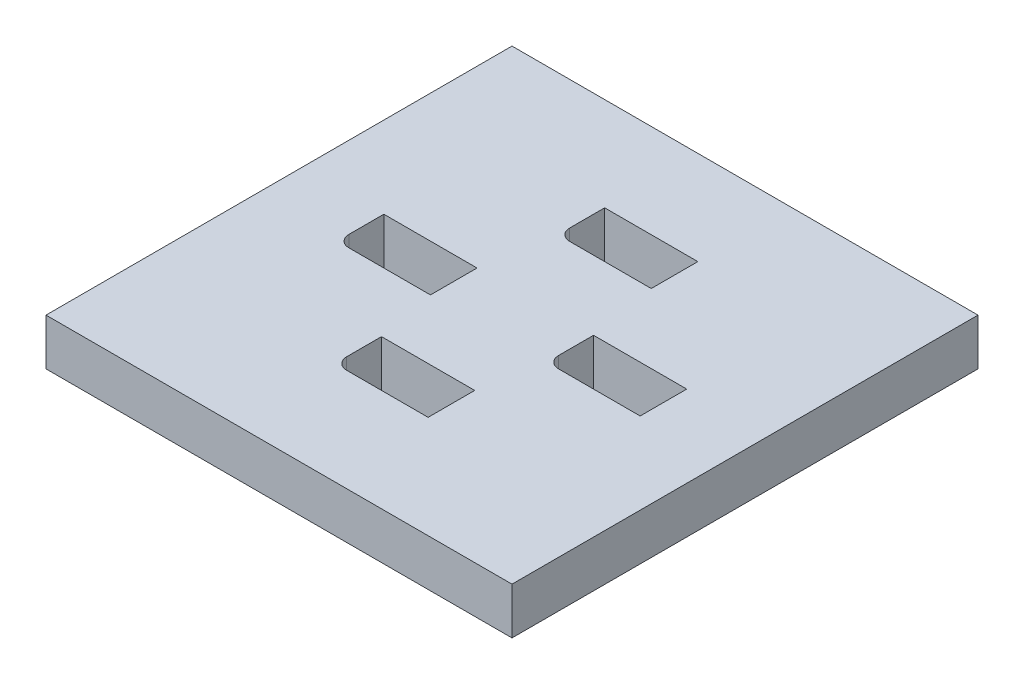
ISO-10303-21;
HEADER;
FILE_DESCRIPTION(('STEP AP214'),'2;1');
FILE_NAME('part.step','',(''),(''),'','','');
FILE_SCHEMA(('AUTOMOTIVE_DESIGN { 1 0 10303 214 1 1 1 1 }'));
ENDSEC;
DATA;
#1=APPLICATION_CONTEXT('core data for automotive mechanical design processes');
#2=APPLICATION_PROTOCOL_DEFINITION('international standard','automotive_design',2000,#1);
#3=PRODUCT_CONTEXT('',#1,'mechanical');
#4=PRODUCT('Part','Part','',(#3));
#5=PRODUCT_RELATED_PRODUCT_CATEGORY('part','',(#4));
#6=PRODUCT_DEFINITION_FORMATION('','',#4);
#7=PRODUCT_DEFINITION_CONTEXT('part definition',#1,'design');
#8=PRODUCT_DEFINITION('design','',#6,#7);
#9=PRODUCT_DEFINITION_SHAPE('','',#8);
#10=(LENGTH_UNIT() NAMED_UNIT(*) SI_UNIT(.MILLI.,.METRE.));
#11=(NAMED_UNIT(*) PLANE_ANGLE_UNIT() SI_UNIT($,.RADIAN.));
#12=(NAMED_UNIT(*) SI_UNIT($,.STERADIAN.) SOLID_ANGLE_UNIT());
#13=UNCERTAINTY_MEASURE_WITH_UNIT(LENGTH_MEASURE(1.E-05),#10,'distance_accuracy_value','');
#14=(GEOMETRIC_REPRESENTATION_CONTEXT(3) GLOBAL_UNCERTAINTY_ASSIGNED_CONTEXT((#13)) GLOBAL_UNIT_ASSIGNED_CONTEXT((#10,
#11,#12)) REPRESENTATION_CONTEXT('',''));
#15=CARTESIAN_POINT('',(0.,0.,0.));
#16=DIRECTION('',(0.,0.,1.));
#17=DIRECTION('',(1.,0.,0.));
#18=AXIS2_PLACEMENT_3D('',#15,#16,#17);
#19=CARTESIAN_POINT('',(63.5,12.7,63.5));
#20=DIRECTION('',(-1.,0.,0.));
#21=DIRECTION('',(0.,0.,1.));
#22=AXIS2_PLACEMENT_3D('',#19,#20,#21);
#23=PLANE('',#22);
#24=DIRECTION('',(0.,0.,-1.));
#25=VECTOR('',#24,1.);
#26=CARTESIAN_POINT('',(63.5,0.,63.5));
#27=LINE('',#26,#25);
#28=CARTESIAN_POINT('',(63.5,0.,63.5));
#29=VERTEX_POINT('',#28);
#30=CARTESIAN_POINT('',(63.5,0.,-63.5));
#31=VERTEX_POINT('',#30);
#32=EDGE_CURVE('E242',#29,#31,#27,.T.);
#33=ORIENTED_EDGE('',*,*,#32,.T.);
#34=DIRECTION('',(0.,-1.,0.));
#35=VECTOR('',#34,1.);
#36=CARTESIAN_POINT('',(63.5,12.7,-63.5));
#37=LINE('',#36,#35);
#38=CARTESIAN_POINT('',(63.5,12.7,-63.5));
#39=VERTEX_POINT('',#38);
#40=EDGE_CURVE('E12',#39,#31,#37,.T.);
#41=ORIENTED_EDGE('',*,*,#40,.F.);
#42=DIRECTION('',(0.,0.,-1.));
#43=VECTOR('',#42,1.);
#44=CARTESIAN_POINT('',(63.5,12.7,63.5));
#45=LINE('',#44,#43);
#46=CARTESIAN_POINT('',(63.5,12.7,63.5));
#47=VERTEX_POINT('',#46);
#48=EDGE_CURVE('E366',#47,#39,#45,.T.);
#49=ORIENTED_EDGE('',*,*,#48,.F.);
#50=DIRECTION('',(0.,-1.,0.));
#51=VECTOR('',#50,1.);
#52=CARTESIAN_POINT('',(63.5,12.7,63.5));
#53=LINE('',#52,#51);
#54=EDGE_CURVE('E376',#47,#29,#53,.T.);
#55=ORIENTED_EDGE('',*,*,#54,.T.);
#56=EDGE_LOOP('',(#33,#41,#49,#55));
#57=FACE_BOUND('',#56,.T.);
#58=ADVANCED_FACE('F39',(#57),#23,.F.);
#59=CARTESIAN_POINT('',(-63.5,12.7,-63.5));
#60=DIRECTION('',(0.,0.,1.));
#61=DIRECTION('',(1.,0.,0.));
#62=AXIS2_PLACEMENT_3D('',#59,#60,#61);
#63=PLANE('',#62);
#64=DIRECTION('',(-1.,0.,0.));
#65=VECTOR('',#64,1.);
#66=CARTESIAN_POINT('',(-63.5,0.,-63.5));
#67=LINE('',#66,#65);
#68=CARTESIAN_POINT('',(-63.5,0.,-63.5));
#69=VERTEX_POINT('',#68);
#70=EDGE_CURVE('E379',#31,#69,#67,.T.);
#71=ORIENTED_EDGE('',*,*,#70,.T.);
#72=DIRECTION('',(0.,-1.,0.));
#73=VECTOR('',#72,1.);
#74=CARTESIAN_POINT('',(-63.5,12.7,-63.5));
#75=LINE('',#74,#73);
#76=CARTESIAN_POINT('',(-63.5,12.7,-63.5));
#77=VERTEX_POINT('',#76);
#78=EDGE_CURVE('E46',#77,#69,#75,.T.);
#79=ORIENTED_EDGE('',*,*,#78,.F.);
#80=DIRECTION('',(-1.,0.,0.));
#81=VECTOR('',#80,1.);
#82=CARTESIAN_POINT('',(-63.5,12.7,-63.5));
#83=LINE('',#82,#81);
#84=EDGE_CURVE('E369',#39,#77,#83,.T.);
#85=ORIENTED_EDGE('',*,*,#84,.F.);
#86=ORIENTED_EDGE('',*,*,#40,.T.);
#87=EDGE_LOOP('',(#71,#79,#85,#86));
#88=FACE_BOUND('',#87,.T.);
#89=ADVANCED_FACE('F410',(#88),#63,.F.);
#90=CARTESIAN_POINT('',(-63.5,12.7,63.5));
#91=DIRECTION('',(1.,0.,0.));
#92=DIRECTION('',(0.,0.,-1.));
#93=AXIS2_PLACEMENT_3D('',#90,#91,#92);
#94=PLANE('',#93);
#95=DIRECTION('',(0.,0.,1.));
#96=VECTOR('',#95,1.);
#97=CARTESIAN_POINT('',(-63.5,0.,63.5));
#98=LINE('',#97,#96);
#99=CARTESIAN_POINT('',(-63.5,0.,63.5));
#100=VERTEX_POINT('',#99);
#101=EDGE_CURVE('E381',#69,#100,#98,.T.);
#102=ORIENTED_EDGE('',*,*,#101,.T.);
#103=DIRECTION('',(0.,-1.,0.));
#104=VECTOR('',#103,1.);
#105=CARTESIAN_POINT('',(-63.5,12.7,63.5));
#106=LINE('',#105,#104);
#107=CARTESIAN_POINT('',(-63.5,12.7,63.5));
#108=VERTEX_POINT('',#107);
#109=EDGE_CURVE('E386',#108,#100,#106,.T.);
#110=ORIENTED_EDGE('',*,*,#109,.F.);
#111=DIRECTION('',(0.,0.,1.));
#112=VECTOR('',#111,1.);
#113=CARTESIAN_POINT('',(-63.5,12.7,63.5));
#114=LINE('',#113,#112);
#115=EDGE_CURVE('E372',#77,#108,#114,.T.);
#116=ORIENTED_EDGE('',*,*,#115,.F.);
#117=ORIENTED_EDGE('',*,*,#78,.T.);
#118=EDGE_LOOP('',(#102,#110,#116,#117));
#119=FACE_BOUND('',#118,.T.);
#120=ADVANCED_FACE('F395',(#119),#94,.F.);
#121=CARTESIAN_POINT('',(-63.5,12.7,63.5));
#122=DIRECTION('',(0.,0.,-1.));
#123=DIRECTION('',(-1.,0.,0.));
#124=AXIS2_PLACEMENT_3D('',#121,#122,#123);
#125=PLANE('',#124);
#126=DIRECTION('',(1.,0.,0.));
#127=VECTOR('',#126,1.);
#128=CARTESIAN_POINT('',(-63.5,0.,63.5));
#129=LINE('',#128,#127);
#130=EDGE_CURVE('E370',#100,#29,#129,.T.);
#131=ORIENTED_EDGE('',*,*,#130,.T.);
#132=ORIENTED_EDGE('',*,*,#54,.F.);
#133=DIRECTION('',(1.,0.,0.));
#134=VECTOR('',#133,1.);
#135=CARTESIAN_POINT('',(-63.5,12.7,63.5));
#136=LINE('',#135,#134);
#137=EDGE_CURVE('E374',#108,#47,#136,.T.);
#138=ORIENTED_EDGE('',*,*,#137,.F.);
#139=ORIENTED_EDGE('',*,*,#109,.T.);
#140=EDGE_LOOP('',(#131,#132,#138,#139));
#141=FACE_BOUND('',#140,.T.);
#142=ADVANCED_FACE('F403',(#141),#125,.F.);
#143=CARTESIAN_POINT('',(0.,12.7,0.));
#144=DIRECTION('',(0.,-1.,0.));
#145=DIRECTION('',(0.,0.,-1.));
#146=AXIS2_PLACEMENT_3D('',#143,#144,#145);
#147=PLANE('',#146);
#148=DIRECTION('',(0.,0.,1.));
#149=VECTOR('',#148,1.);
#150=CARTESIAN_POINT('',(-12.7,12.7,-37.9498546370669));
#151=LINE('',#150,#149);
#152=CARTESIAN_POINT('',(-12.7,12.7,-37.9498546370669));
#153=VERTEX_POINT('',#152);
#154=CARTESIAN_POINT('',(-12.7,12.7,-28.4248546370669));
#155=VERTEX_POINT('',#154);
#156=EDGE_CURVE('E232',#153,#155,#151,.T.);
#157=ORIENTED_EDGE('',*,*,#156,.F.);
#158=DIRECTION('',(-1.,0.,0.));
#159=VECTOR('',#158,1.);
#160=CARTESIAN_POINT('',(-12.7,12.7,-37.9498546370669));
#161=LINE('',#160,#159);
#162=CARTESIAN_POINT('',(12.7,12.7,-37.9498546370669));
#163=VERTEX_POINT('',#162);
#164=EDGE_CURVE('E53',#163,#153,#161,.T.);
#165=ORIENTED_EDGE('',*,*,#164,.F.);
#166=DIRECTION('',(0.,0.,-1.));
#167=VECTOR('',#166,1.);
#168=CARTESIAN_POINT('',(12.7,12.7,-37.9498546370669));
#169=LINE('',#168,#167);
#170=CARTESIAN_POINT('',(12.7,12.7,-25.2498546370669));
#171=VERTEX_POINT('',#170);
#172=EDGE_CURVE('E221',#171,#163,#169,.T.);
#173=ORIENTED_EDGE('',*,*,#172,.F.);
#174=DIRECTION('',(1.,0.,0.));
#175=VECTOR('',#174,1.);
#176=CARTESIAN_POINT('',(-9.52499999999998,12.7,-25.2498546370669));
#177=LINE('',#176,#175);
#178=CARTESIAN_POINT('',(-9.52499999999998,12.7,-25.2498546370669));
#179=VERTEX_POINT('',#178);
#180=EDGE_CURVE('E224',#179,#171,#177,.T.);
#181=ORIENTED_EDGE('',*,*,#180,.F.);
#182=CARTESIAN_POINT('',(-9.52499999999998,12.7,-28.4248546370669));
#183=DIRECTION('',(0.,1.,0.));
#184=DIRECTION('',(0.,0.,1.));
#185=AXIS2_PLACEMENT_3D('',#182,#183,#184);
#186=CIRCLE('',#185,3.175);
#187=EDGE_CURVE('E235',#155,#179,#186,.T.);
#188=ORIENTED_EDGE('',*,*,#187,.F.);
#189=EDGE_LOOP('',(#157,#165,#173,#181,#188));
#190=FACE_BOUND('',#189,.T.);
#191=DIRECTION('',(-1.,0.,0.));
#192=VECTOR('',#191,1.);
#193=CARTESIAN_POINT('',(-15.875,12.7,-6.34999999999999));
#194=LINE('',#193,#192);
#195=CARTESIAN_POINT('',(-15.875,12.7,-6.34999999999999));
#196=VERTEX_POINT('',#195);
#197=CARTESIAN_POINT('',(-41.275,12.7,-6.34999999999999));
#198=VERTEX_POINT('',#197);
#199=EDGE_CURVE('E266',#196,#198,#194,.T.);
#200=ORIENTED_EDGE('',*,*,#199,.F.);
#201=DIRECTION('',(0.,0.,-1.));
#202=VECTOR('',#201,1.);
#203=CARTESIAN_POINT('',(-15.875,12.7,-6.34999999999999));
#204=LINE('',#203,#202);
#205=CARTESIAN_POINT('',(-15.875,12.7,6.35000000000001));
#206=VERTEX_POINT('',#205);
#207=EDGE_CURVE('E61',#206,#196,#204,.T.);
#208=ORIENTED_EDGE('',*,*,#207,.F.);
#209=DIRECTION('',(1.,0.,0.));
#210=VECTOR('',#209,1.);
#211=CARTESIAN_POINT('',(-15.875,12.7,6.35000000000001));
#212=LINE('',#211,#210);
#213=CARTESIAN_POINT('',(-38.1,12.7,6.35000000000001));
#214=VERTEX_POINT('',#213);
#215=EDGE_CURVE('E252',#214,#206,#212,.T.);
#216=ORIENTED_EDGE('',*,*,#215,.F.);
#217=CARTESIAN_POINT('',(-38.1,12.7,3.17500000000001));
#218=DIRECTION('',(0.,1.,0.));
#219=DIRECTION('',(0.,0.,1.));
#220=AXIS2_PLACEMENT_3D('',#217,#218,#219);
#221=CIRCLE('',#220,3.175);
#222=CARTESIAN_POINT('',(-41.275,12.7,3.17500000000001));
#223=VERTEX_POINT('',#222);
#224=EDGE_CURVE('E273',#223,#214,#221,.T.);
#225=ORIENTED_EDGE('',*,*,#224,.F.);
#226=DIRECTION('',(0.,0.,1.));
#227=VECTOR('',#226,1.);
#228=CARTESIAN_POINT('',(-41.275,12.7,-6.34999999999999));
#229=LINE('',#228,#227);
#230=EDGE_CURVE('E270',#198,#223,#229,.T.);
#231=ORIENTED_EDGE('',*,*,#230,.F.);
#232=EDGE_LOOP('',(#200,#208,#216,#225,#231));
#233=FACE_BOUND('',#232,.T.);
#234=CARTESIAN_POINT('',(19.05,12.7,3.17500000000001));
#235=DIRECTION('',(0.,1.,0.));
#236=DIRECTION('',(0.,0.,-1.));
#237=AXIS2_PLACEMENT_3D('',#234,#235,#236);
#238=CIRCLE('',#237,3.175);
#239=CARTESIAN_POINT('',(15.875,12.7,3.17500000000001));
#240=VERTEX_POINT('',#239);
#241=CARTESIAN_POINT('',(19.05,12.7,6.35000000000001));
#242=VERTEX_POINT('',#241);
#243=EDGE_CURVE('E306',#240,#242,#238,.T.);
#244=ORIENTED_EDGE('',*,*,#243,.F.);
#245=DIRECTION('',(0.,0.,1.));
#246=VECTOR('',#245,1.);
#247=CARTESIAN_POINT('',(15.875,12.7,-6.34999999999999));
#248=LINE('',#247,#246);
#249=CARTESIAN_POINT('',(15.875,12.7,-6.34999999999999));
#250=VERTEX_POINT('',#249);
#251=EDGE_CURVE('E304',#250,#240,#248,.T.);
#252=ORIENTED_EDGE('',*,*,#251,.F.);
#253=DIRECTION('',(-1.,0.,0.));
#254=VECTOR('',#253,1.);
#255=CARTESIAN_POINT('',(15.875,12.7,-6.34999999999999));
#256=LINE('',#255,#254);
#257=CARTESIAN_POINT('',(41.275,12.7,-6.34999999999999));
#258=VERTEX_POINT('',#257);
#259=EDGE_CURVE('E291',#258,#250,#256,.T.);
#260=ORIENTED_EDGE('',*,*,#259,.F.);
#261=DIRECTION('',(0.,0.,-1.));
#262=VECTOR('',#261,1.);
#263=CARTESIAN_POINT('',(41.275,12.7,-6.34999999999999));
#264=LINE('',#263,#262);
#265=CARTESIAN_POINT('',(41.275,12.7,6.35000000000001));
#266=VERTEX_POINT('',#265);
#267=EDGE_CURVE('E313',#266,#258,#264,.T.);
#268=ORIENTED_EDGE('',*,*,#267,.F.);
#269=DIRECTION('',(1.,0.,0.));
#270=VECTOR('',#269,1.);
#271=CARTESIAN_POINT('',(19.05,12.7,6.35000000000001));
#272=LINE('',#271,#270);
#273=EDGE_CURVE('E310',#242,#266,#272,.T.);
#274=ORIENTED_EDGE('',*,*,#273,.F.);
#275=EDGE_LOOP('',(#244,#252,#260,#268,#274));
#276=FACE_BOUND('',#275,.T.);
#277=DIRECTION('',(0.,0.,1.));
#278=VECTOR('',#277,1.);
#279=CARTESIAN_POINT('',(-12.7,12.7,22.86));
#280=LINE('',#279,#278);
#281=CARTESIAN_POINT('',(-12.7,12.7,22.86));
#282=VERTEX_POINT('',#281);
#283=CARTESIAN_POINT('',(-12.7,12.7,32.385));
#284=VERTEX_POINT('',#283);
#285=EDGE_CURVE('E346',#282,#284,#280,.T.);
#286=ORIENTED_EDGE('',*,*,#285,.F.);
#287=DIRECTION('',(-1.,0.,0.));
#288=VECTOR('',#287,1.);
#289=CARTESIAN_POINT('',(-12.7,12.7,22.86));
#290=LINE('',#289,#288);
#291=CARTESIAN_POINT('',(12.7,12.7,22.86));
#292=VERTEX_POINT('',#291);
#293=EDGE_CURVE('E344',#292,#282,#290,.T.);
#294=ORIENTED_EDGE('',*,*,#293,.F.);
#295=DIRECTION('',(0.,0.,-1.));
#296=VECTOR('',#295,1.);
#297=CARTESIAN_POINT('',(12.7,12.7,22.86));
#298=LINE('',#297,#296);
#299=CARTESIAN_POINT('',(12.7,12.7,35.56));
#300=VERTEX_POINT('',#299);
#301=EDGE_CURVE('E331',#300,#292,#298,.T.);
#302=ORIENTED_EDGE('',*,*,#301,.F.);
#303=DIRECTION('',(1.,0.,0.));
#304=VECTOR('',#303,1.);
#305=CARTESIAN_POINT('',(-9.52499999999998,12.7,35.56));
#306=LINE('',#305,#304);
#307=CARTESIAN_POINT('',(-9.52499999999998,12.7,35.56));
#308=VERTEX_POINT('',#307);
#309=EDGE_CURVE('E352',#308,#300,#306,.T.);
#310=ORIENTED_EDGE('',*,*,#309,.F.);
#311=CARTESIAN_POINT('',(-9.52499999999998,12.7,32.385));
#312=DIRECTION('',(0.,1.,0.));
#313=DIRECTION('',(0.,0.,1.));
#314=AXIS2_PLACEMENT_3D('',#311,#312,#313);
#315=CIRCLE('',#314,3.175);
#316=EDGE_CURVE('E349',#284,#308,#315,.T.);
#317=ORIENTED_EDGE('',*,*,#316,.F.);
#318=EDGE_LOOP('',(#286,#294,#302,#310,#317));
#319=FACE_BOUND('',#318,.T.);
#320=ORIENTED_EDGE('',*,*,#48,.T.);
#321=ORIENTED_EDGE('',*,*,#84,.T.);
#322=ORIENTED_EDGE('',*,*,#115,.T.);
#323=ORIENTED_EDGE('',*,*,#137,.T.);
#324=EDGE_LOOP('',(#320,#321,#322,#323));
#325=FACE_BOUND('',#324,.T.);
#326=ADVANCED_FACE('F409',(#190,#233,#276,#319,#325),#147,.F.);
#327=CARTESIAN_POINT('',(0.,0.,0.));
#328=DIRECTION('',(0.,-1.,0.));
#329=DIRECTION('',(0.,0.,-1.));
#330=AXIS2_PLACEMENT_3D('',#327,#328,#329);
#331=PLANE('',#330);
#332=DIRECTION('',(-1.,0.,0.));
#333=VECTOR('',#332,1.);
#334=CARTESIAN_POINT('',(-12.7,0.,-37.9498546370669));
#335=LINE('',#334,#333);
#336=CARTESIAN_POINT('',(12.7,0.,-37.9498546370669));
#337=VERTEX_POINT('',#336);
#338=CARTESIAN_POINT('',(-12.7,0.,-37.9498546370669));
#339=VERTEX_POINT('',#338);
#340=EDGE_CURVE('E201',#337,#339,#335,.T.);
#341=ORIENTED_EDGE('',*,*,#340,.T.);
#342=DIRECTION('',(0.,0.,1.));
#343=VECTOR('',#342,1.);
#344=CARTESIAN_POINT('',(-12.7,0.,-37.9498546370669));
#345=LINE('',#344,#343);
#346=CARTESIAN_POINT('',(-12.7,0.,-28.4248546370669));
#347=VERTEX_POINT('',#346);
#348=EDGE_CURVE('E211',#339,#347,#345,.T.);
#349=ORIENTED_EDGE('',*,*,#348,.T.);
#350=CARTESIAN_POINT('',(-9.52499999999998,0.,-28.4248546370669));
#351=DIRECTION('',(0.,1.,0.));
#352=DIRECTION('',(0.,0.,1.));
#353=AXIS2_PLACEMENT_3D('',#350,#351,#352);
#354=CIRCLE('',#353,3.175);
#355=CARTESIAN_POINT('',(-9.52499999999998,0.,-25.2498546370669));
#356=VERTEX_POINT('',#355);
#357=EDGE_CURVE('E215',#347,#356,#354,.T.);
#358=ORIENTED_EDGE('',*,*,#357,.T.);
#359=DIRECTION('',(1.,0.,0.));
#360=VECTOR('',#359,1.);
#361=CARTESIAN_POINT('',(-9.52499999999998,0.,-25.2498546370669));
#362=LINE('',#361,#360);
#363=CARTESIAN_POINT('',(12.7,0.,-25.2498546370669));
#364=VERTEX_POINT('',#363);
#365=EDGE_CURVE('E228',#356,#364,#362,.T.);
#366=ORIENTED_EDGE('',*,*,#365,.T.);
#367=DIRECTION('',(0.,0.,-1.));
#368=VECTOR('',#367,1.);
#369=CARTESIAN_POINT('',(12.7,0.,-37.9498546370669));
#370=LINE('',#369,#368);
#371=EDGE_CURVE('E207',#364,#337,#370,.T.);
#372=ORIENTED_EDGE('',*,*,#371,.T.);
#373=EDGE_LOOP('',(#341,#349,#358,#366,#372));
#374=FACE_BOUND('',#373,.T.);
#375=DIRECTION('',(0.,0.,-1.));
#376=VECTOR('',#375,1.);
#377=CARTESIAN_POINT('',(-15.875,0.,-6.34999999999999));
#378=LINE('',#377,#376);
#379=CARTESIAN_POINT('',(-15.875,0.,6.35000000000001));
#380=VERTEX_POINT('',#379);
#381=CARTESIAN_POINT('',(-15.875,0.,-6.34999999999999));
#382=VERTEX_POINT('',#381);
#383=EDGE_CURVE('E248',#380,#382,#378,.T.);
#384=ORIENTED_EDGE('',*,*,#383,.T.);
#385=DIRECTION('',(-1.,0.,0.));
#386=VECTOR('',#385,1.);
#387=CARTESIAN_POINT('',(-15.875,0.,-6.34999999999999));
#388=LINE('',#387,#386);
#389=CARTESIAN_POINT('',(-41.275,0.,-6.34999999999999));
#390=VERTEX_POINT('',#389);
#391=EDGE_CURVE('E251',#382,#390,#388,.T.);
#392=ORIENTED_EDGE('',*,*,#391,.T.);
#393=DIRECTION('',(0.,0.,1.));
#394=VECTOR('',#393,1.);
#395=CARTESIAN_POINT('',(-41.275,0.,-6.34999999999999));
#396=LINE('',#395,#394);
#397=CARTESIAN_POINT('',(-41.275,0.,3.17500000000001));
#398=VERTEX_POINT('',#397);
#399=EDGE_CURVE('E255',#390,#398,#396,.T.);
#400=ORIENTED_EDGE('',*,*,#399,.T.);
#401=CARTESIAN_POINT('',(-38.1,0.,3.17500000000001));
#402=DIRECTION('',(0.,1.,0.));
#403=DIRECTION('',(0.,0.,1.));
#404=AXIS2_PLACEMENT_3D('',#401,#402,#403);
#405=CIRCLE('',#404,3.175);
#406=CARTESIAN_POINT('',(-38.1,0.,6.35000000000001));
#407=VERTEX_POINT('',#406);
#408=EDGE_CURVE('E258',#398,#407,#405,.T.);
#409=ORIENTED_EDGE('',*,*,#408,.T.);
#410=DIRECTION('',(1.,0.,0.));
#411=VECTOR('',#410,1.);
#412=CARTESIAN_POINT('',(-15.875,0.,6.35000000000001));
#413=LINE('',#412,#411);
#414=EDGE_CURVE('E261',#407,#380,#413,.T.);
#415=ORIENTED_EDGE('',*,*,#414,.T.);
#416=EDGE_LOOP('',(#384,#392,#400,#409,#415));
#417=FACE_BOUND('',#416,.T.);
#418=DIRECTION('',(0.,0.,1.));
#419=VECTOR('',#418,1.);
#420=CARTESIAN_POINT('',(15.875,0.,-6.34999999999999));
#421=LINE('',#420,#419);
#422=CARTESIAN_POINT('',(15.875,0.,-6.34999999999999));
#423=VERTEX_POINT('',#422);
#424=CARTESIAN_POINT('',(15.875,0.,3.17500000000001));
#425=VERTEX_POINT('',#424);
#426=EDGE_CURVE('E287',#423,#425,#421,.T.);
#427=ORIENTED_EDGE('',*,*,#426,.T.);
#428=CARTESIAN_POINT('',(19.05,0.,3.17500000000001));
#429=DIRECTION('',(0.,1.,0.));
#430=DIRECTION('',(0.,0.,-1.));
#431=AXIS2_PLACEMENT_3D('',#428,#429,#430);
#432=CIRCLE('',#431,3.175);
#433=CARTESIAN_POINT('',(19.05,0.,6.35000000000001));
#434=VERTEX_POINT('',#433);
#435=EDGE_CURVE('E290',#425,#434,#432,.T.);
#436=ORIENTED_EDGE('',*,*,#435,.T.);
#437=DIRECTION('',(1.,0.,0.));
#438=VECTOR('',#437,1.);
#439=CARTESIAN_POINT('',(19.05,0.,6.35000000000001));
#440=LINE('',#439,#438);
#441=CARTESIAN_POINT('',(41.275,0.,6.35000000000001));
#442=VERTEX_POINT('',#441);
#443=EDGE_CURVE('E294',#434,#442,#440,.T.);
#444=ORIENTED_EDGE('',*,*,#443,.T.);
#445=DIRECTION('',(0.,0.,-1.));
#446=VECTOR('',#445,1.);
#447=CARTESIAN_POINT('',(41.275,0.,-6.34999999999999));
#448=LINE('',#447,#446);
#449=CARTESIAN_POINT('',(41.275,0.,-6.34999999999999));
#450=VERTEX_POINT('',#449);
#451=EDGE_CURVE('E297',#442,#450,#448,.T.);
#452=ORIENTED_EDGE('',*,*,#451,.T.);
#453=DIRECTION('',(-1.,0.,0.));
#454=VECTOR('',#453,1.);
#455=CARTESIAN_POINT('',(15.875,0.,-6.34999999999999));
#456=LINE('',#455,#454);
#457=EDGE_CURVE('E300',#450,#423,#456,.T.);
#458=ORIENTED_EDGE('',*,*,#457,.T.);
#459=EDGE_LOOP('',(#427,#436,#444,#452,#458));
#460=FACE_BOUND('',#459,.T.);
#461=DIRECTION('',(-1.,0.,0.));
#462=VECTOR('',#461,1.);
#463=CARTESIAN_POINT('',(-12.7,0.,22.86));
#464=LINE('',#463,#462);
#465=CARTESIAN_POINT('',(12.7,0.,22.86));
#466=VERTEX_POINT('',#465);
#467=CARTESIAN_POINT('',(-12.7,0.,22.86));
#468=VERTEX_POINT('',#467);
#469=EDGE_CURVE('E327',#466,#468,#464,.T.);
#470=ORIENTED_EDGE('',*,*,#469,.T.);
#471=DIRECTION('',(0.,0.,1.));
#472=VECTOR('',#471,1.);
#473=CARTESIAN_POINT('',(-12.7,0.,22.86));
#474=LINE('',#473,#472);
#475=CARTESIAN_POINT('',(-12.7,0.,32.385));
#476=VERTEX_POINT('',#475);
#477=EDGE_CURVE('E330',#468,#476,#474,.T.);
#478=ORIENTED_EDGE('',*,*,#477,.T.);
#479=CARTESIAN_POINT('',(-9.52499999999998,0.,32.385));
#480=DIRECTION('',(0.,1.,0.));
#481=DIRECTION('',(0.,0.,1.));
#482=AXIS2_PLACEMENT_3D('',#479,#480,#481);
#483=CIRCLE('',#482,3.175);
#484=CARTESIAN_POINT('',(-9.52499999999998,0.,35.56));
#485=VERTEX_POINT('',#484);
#486=EDGE_CURVE('E334',#476,#485,#483,.T.);
#487=ORIENTED_EDGE('',*,*,#486,.T.);
#488=DIRECTION('',(1.,0.,0.));
#489=VECTOR('',#488,1.);
#490=CARTESIAN_POINT('',(-9.52499999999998,0.,35.56));
#491=LINE('',#490,#489);
#492=CARTESIAN_POINT('',(12.7,0.,35.56));
#493=VERTEX_POINT('',#492);
#494=EDGE_CURVE('E337',#485,#493,#491,.T.);
#495=ORIENTED_EDGE('',*,*,#494,.T.);
#496=DIRECTION('',(0.,0.,-1.));
#497=VECTOR('',#496,1.);
#498=CARTESIAN_POINT('',(12.7,0.,22.86));
#499=LINE('',#498,#497);
#500=EDGE_CURVE('E340',#493,#466,#499,.T.);
#501=ORIENTED_EDGE('',*,*,#500,.T.);
#502=EDGE_LOOP('',(#470,#478,#487,#495,#501));
#503=FACE_BOUND('',#502,.T.);
#504=ORIENTED_EDGE('',*,*,#32,.F.);
#505=ORIENTED_EDGE('',*,*,#130,.F.);
#506=ORIENTED_EDGE('',*,*,#101,.F.);
#507=ORIENTED_EDGE('',*,*,#70,.F.);
#508=EDGE_LOOP('',(#504,#505,#506,#507));
#509=FACE_BOUND('',#508,.T.);
#510=ADVANCED_FACE('F217',(#374,#417,#460,#503,#509),#331,.T.);
#511=CARTESIAN_POINT('',(-12.7,0.,22.86));
#512=DIRECTION('',(0.,0.,-1.));
#513=DIRECTION('',(-1.,0.,0.));
#514=AXIS2_PLACEMENT_3D('',#511,#512,#513);
#515=PLANE('',#514);
#516=ORIENTED_EDGE('',*,*,#293,.T.);
#517=DIRECTION('',(0.,1.,0.));
#518=VECTOR('',#517,1.);
#519=CARTESIAN_POINT('',(-12.7,0.,22.86));
#520=LINE('',#519,#518);
#521=EDGE_CURVE('E343',#468,#282,#520,.T.);
#522=ORIENTED_EDGE('',*,*,#521,.F.);
#523=ORIENTED_EDGE('',*,*,#469,.F.);
#524=DIRECTION('',(0.,1.,0.));
#525=VECTOR('',#524,1.);
#526=CARTESIAN_POINT('',(12.7,0.,22.86));
#527=LINE('',#526,#525);
#528=EDGE_CURVE('E307',#466,#292,#527,.T.);
#529=ORIENTED_EDGE('',*,*,#528,.T.);
#530=EDGE_LOOP('',(#516,#522,#523,#529));
#531=FACE_BOUND('',#530,.T.);
#532=ADVANCED_FACE('F422',(#531),#515,.F.);
#533=CARTESIAN_POINT('',(12.7,0.,22.86));
#534=DIRECTION('',(1.,0.,0.));
#535=DIRECTION('',(0.,0.,-1.));
#536=AXIS2_PLACEMENT_3D('',#533,#534,#535);
#537=PLANE('',#536);
#538=ORIENTED_EDGE('',*,*,#301,.T.);
#539=ORIENTED_EDGE('',*,*,#528,.F.);
#540=ORIENTED_EDGE('',*,*,#500,.F.);
#541=DIRECTION('',(0.,1.,0.));
#542=VECTOR('',#541,1.);
#543=CARTESIAN_POINT('',(12.7,0.,35.56));
#544=LINE('',#543,#542);
#545=EDGE_CURVE('E358',#493,#300,#544,.T.);
#546=ORIENTED_EDGE('',*,*,#545,.T.);
#547=EDGE_LOOP('',(#538,#539,#540,#546));
#548=FACE_BOUND('',#547,.T.);
#549=ADVANCED_FACE('F428',(#548),#537,.F.);
#550=CARTESIAN_POINT('',(-9.52499999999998,0.,35.56));
#551=DIRECTION('',(0.,0.,1.));
#552=DIRECTION('',(1.,0.,0.));
#553=AXIS2_PLACEMENT_3D('',#550,#551,#552);
#554=PLANE('',#553);
#555=ORIENTED_EDGE('',*,*,#309,.T.);
#556=ORIENTED_EDGE('',*,*,#545,.F.);
#557=ORIENTED_EDGE('',*,*,#494,.F.);
#558=DIRECTION('',(0.,1.,0.));
#559=VECTOR('',#558,1.);
#560=CARTESIAN_POINT('',(-9.52499999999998,0.,35.56));
#561=LINE('',#560,#559);
#562=EDGE_CURVE('E360',#485,#308,#561,.T.);
#563=ORIENTED_EDGE('',*,*,#562,.T.);
#564=EDGE_LOOP('',(#555,#556,#557,#563));
#565=FACE_BOUND('',#564,.T.);
#566=ADVANCED_FACE('F438',(#565),#554,.F.);
#567=CARTESIAN_POINT('',(-9.52499999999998,0.,32.385));
#568=DIRECTION('',(0.,1.,0.));
#569=DIRECTION('',(0.,0.,1.));
#570=AXIS2_PLACEMENT_3D('',#567,#568,#569);
#571=CYLINDRICAL_SURFACE('',#570,3.175);
#572=ORIENTED_EDGE('',*,*,#316,.T.);
#573=ORIENTED_EDGE('',*,*,#562,.F.);
#574=ORIENTED_EDGE('',*,*,#486,.F.);
#575=DIRECTION('',(0.,1.,0.));
#576=VECTOR('',#575,1.);
#577=CARTESIAN_POINT('',(-12.7,0.,32.385));
#578=LINE('',#577,#576);
#579=EDGE_CURVE('E362',#476,#284,#578,.T.);
#580=ORIENTED_EDGE('',*,*,#579,.T.);
#581=EDGE_LOOP('',(#572,#573,#574,#580));
#582=FACE_BOUND('',#581,.T.);
#583=ADVANCED_FACE('F434',(#582),#571,.F.);
#584=CARTESIAN_POINT('',(-12.7,0.,22.86));
#585=DIRECTION('',(-1.,0.,0.));
#586=DIRECTION('',(0.,0.,1.));
#587=AXIS2_PLACEMENT_3D('',#584,#585,#586);
#588=PLANE('',#587);
#589=ORIENTED_EDGE('',*,*,#285,.T.);
#590=ORIENTED_EDGE('',*,*,#579,.F.);
#591=ORIENTED_EDGE('',*,*,#477,.F.);
#592=ORIENTED_EDGE('',*,*,#521,.T.);
#593=EDGE_LOOP('',(#589,#590,#591,#592));
#594=FACE_BOUND('',#593,.T.);
#595=ADVANCED_FACE('F430',(#594),#588,.F.);
#596=CARTESIAN_POINT('',(15.875,0.,-6.34999999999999));
#597=DIRECTION('',(-1.,0.,0.));
#598=DIRECTION('',(0.,0.,1.));
#599=AXIS2_PLACEMENT_3D('',#596,#597,#598);
#600=PLANE('',#599);
#601=ORIENTED_EDGE('',*,*,#251,.T.);
#602=DIRECTION('',(0.,1.,0.));
#603=VECTOR('',#602,1.);
#604=CARTESIAN_POINT('',(15.875,0.,3.17500000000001));
#605=LINE('',#604,#603);
#606=EDGE_CURVE('E303',#425,#240,#605,.T.);
#607=ORIENTED_EDGE('',*,*,#606,.F.);
#608=ORIENTED_EDGE('',*,*,#426,.F.);
#609=DIRECTION('',(0.,1.,0.));
#610=VECTOR('',#609,1.);
#611=CARTESIAN_POINT('',(15.875,0.,-6.34999999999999));
#612=LINE('',#611,#610);
#613=EDGE_CURVE('E267',#423,#250,#612,.T.);
#614=ORIENTED_EDGE('',*,*,#613,.T.);
#615=EDGE_LOOP('',(#601,#607,#608,#614));
#616=FACE_BOUND('',#615,.T.);
#617=ADVANCED_FACE('F433',(#616),#600,.F.);
#618=CARTESIAN_POINT('',(15.875,0.,-6.34999999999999));
#619=DIRECTION('',(0.,0.,-1.));
#620=DIRECTION('',(-1.,0.,0.));
#621=AXIS2_PLACEMENT_3D('',#618,#619,#620);
#622=PLANE('',#621);
#623=ORIENTED_EDGE('',*,*,#259,.T.);
#624=ORIENTED_EDGE('',*,*,#613,.F.);
#625=ORIENTED_EDGE('',*,*,#457,.F.);
#626=DIRECTION('',(0.,1.,0.));
#627=VECTOR('',#626,1.);
#628=CARTESIAN_POINT('',(41.275,0.,-6.34999999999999));
#629=LINE('',#628,#627);
#630=EDGE_CURVE('E319',#450,#258,#629,.T.);
#631=ORIENTED_EDGE('',*,*,#630,.T.);
#632=EDGE_LOOP('',(#623,#624,#625,#631));
#633=FACE_BOUND('',#632,.T.);
#634=ADVANCED_FACE('F448',(#633),#622,.F.);
#635=CARTESIAN_POINT('',(41.275,0.,-6.34999999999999));
#636=DIRECTION('',(1.,0.,0.));
#637=DIRECTION('',(0.,0.,-1.));
#638=AXIS2_PLACEMENT_3D('',#635,#636,#637);
#639=PLANE('',#638);
#640=ORIENTED_EDGE('',*,*,#267,.T.);
#641=ORIENTED_EDGE('',*,*,#630,.F.);
#642=ORIENTED_EDGE('',*,*,#451,.F.);
#643=DIRECTION('',(0.,1.,0.));
#644=VECTOR('',#643,1.);
#645=CARTESIAN_POINT('',(41.275,0.,6.35000000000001));
#646=LINE('',#645,#644);
#647=EDGE_CURVE('E321',#442,#266,#646,.T.);
#648=ORIENTED_EDGE('',*,*,#647,.T.);
#649=EDGE_LOOP('',(#640,#641,#642,#648));
#650=FACE_BOUND('',#649,.T.);
#651=ADVANCED_FACE('F458',(#650),#639,.F.);
#652=CARTESIAN_POINT('',(19.05,0.,6.35000000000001));
#653=DIRECTION('',(0.,0.,1.));
#654=DIRECTION('',(1.,0.,0.));
#655=AXIS2_PLACEMENT_3D('',#652,#653,#654);
#656=PLANE('',#655);
#657=ORIENTED_EDGE('',*,*,#273,.T.);
#658=ORIENTED_EDGE('',*,*,#647,.F.);
#659=ORIENTED_EDGE('',*,*,#443,.F.);
#660=DIRECTION('',(0.,1.,0.));
#661=VECTOR('',#660,1.);
#662=CARTESIAN_POINT('',(19.05,0.,6.35000000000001));
#663=LINE('',#662,#661);
#664=EDGE_CURVE('E323',#434,#242,#663,.T.);
#665=ORIENTED_EDGE('',*,*,#664,.T.);
#666=EDGE_LOOP('',(#657,#658,#659,#665));
#667=FACE_BOUND('',#666,.T.);
#668=ADVANCED_FACE('F454',(#667),#656,.F.);
#669=CARTESIAN_POINT('',(19.05,0.,3.17500000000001));
#670=DIRECTION('',(0.,1.,0.));
#671=DIRECTION('',(0.,0.,1.));
#672=AXIS2_PLACEMENT_3D('',#669,#670,#671);
#673=CYLINDRICAL_SURFACE('',#672,3.175);
#674=ORIENTED_EDGE('',*,*,#243,.T.);
#675=ORIENTED_EDGE('',*,*,#664,.F.);
#676=ORIENTED_EDGE('',*,*,#435,.F.);
#677=ORIENTED_EDGE('',*,*,#606,.T.);
#678=EDGE_LOOP('',(#674,#675,#676,#677));
#679=FACE_BOUND('',#678,.T.);
#680=ADVANCED_FACE('F450',(#679),#673,.F.);
#681=CARTESIAN_POINT('',(-15.875,0.,-6.34999999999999));
#682=DIRECTION('',(1.,0.,0.));
#683=DIRECTION('',(0.,0.,-1.));
#684=AXIS2_PLACEMENT_3D('',#681,#682,#683);
#685=PLANE('',#684);
#686=ORIENTED_EDGE('',*,*,#207,.T.);
#687=DIRECTION('',(0.,1.,0.));
#688=VECTOR('',#687,1.);
#689=CARTESIAN_POINT('',(-15.875,0.,-6.34999999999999));
#690=LINE('',#689,#688);
#691=EDGE_CURVE('E264',#382,#196,#690,.T.);
#692=ORIENTED_EDGE('',*,*,#691,.F.);
#693=ORIENTED_EDGE('',*,*,#383,.F.);
#694=DIRECTION('',(0.,1.,0.));
#695=VECTOR('',#694,1.);
#696=CARTESIAN_POINT('',(-15.875,0.,6.35000000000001));
#697=LINE('',#696,#695);
#698=EDGE_CURVE('E233',#380,#206,#697,.T.);
#699=ORIENTED_EDGE('',*,*,#698,.T.);
#700=EDGE_LOOP('',(#686,#692,#693,#699));
#701=FACE_BOUND('',#700,.T.);
#702=ADVANCED_FACE('F453',(#701),#685,.F.);
#703=CARTESIAN_POINT('',(-15.875,0.,6.35000000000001));
#704=DIRECTION('',(0.,0.,1.));
#705=DIRECTION('',(1.,0.,0.));
#706=AXIS2_PLACEMENT_3D('',#703,#704,#705);
#707=PLANE('',#706);
#708=ORIENTED_EDGE('',*,*,#215,.T.);
#709=ORIENTED_EDGE('',*,*,#698,.F.);
#710=ORIENTED_EDGE('',*,*,#414,.F.);
#711=DIRECTION('',(0.,1.,0.));
#712=VECTOR('',#711,1.);
#713=CARTESIAN_POINT('',(-38.1,0.,6.35000000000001));
#714=LINE('',#713,#712);
#715=EDGE_CURVE('E280',#407,#214,#714,.T.);
#716=ORIENTED_EDGE('',*,*,#715,.T.);
#717=EDGE_LOOP('',(#708,#709,#710,#716));
#718=FACE_BOUND('',#717,.T.);
#719=ADVANCED_FACE('F468',(#718),#707,.F.);
#720=CARTESIAN_POINT('',(-38.1,0.,3.17500000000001));
#721=DIRECTION('',(0.,1.,0.));
#722=DIRECTION('',(0.,0.,1.));
#723=AXIS2_PLACEMENT_3D('',#720,#721,#722);
#724=CYLINDRICAL_SURFACE('',#723,3.175);
#725=ORIENTED_EDGE('',*,*,#224,.T.);
#726=ORIENTED_EDGE('',*,*,#715,.F.);
#727=ORIENTED_EDGE('',*,*,#408,.F.);
#728=DIRECTION('',(0.,1.,0.));
#729=VECTOR('',#728,1.);
#730=CARTESIAN_POINT('',(-41.275,0.,3.17500000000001));
#731=LINE('',#730,#729);
#732=EDGE_CURVE('E282',#398,#223,#731,.T.);
#733=ORIENTED_EDGE('',*,*,#732,.T.);
#734=EDGE_LOOP('',(#725,#726,#727,#733));
#735=FACE_BOUND('',#734,.T.);
#736=ADVANCED_FACE('F476',(#735),#724,.F.);
#737=CARTESIAN_POINT('',(-41.275,0.,-6.34999999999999));
#738=DIRECTION('',(-1.,0.,0.));
#739=DIRECTION('',(0.,0.,1.));
#740=AXIS2_PLACEMENT_3D('',#737,#738,#739);
#741=PLANE('',#740);
#742=ORIENTED_EDGE('',*,*,#230,.T.);
#743=ORIENTED_EDGE('',*,*,#732,.F.);
#744=ORIENTED_EDGE('',*,*,#399,.F.);
#745=DIRECTION('',(0.,1.,0.));
#746=VECTOR('',#745,1.);
#747=CARTESIAN_POINT('',(-41.275,0.,-6.34999999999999));
#748=LINE('',#747,#746);
#749=EDGE_CURVE('E284',#390,#198,#748,.T.);
#750=ORIENTED_EDGE('',*,*,#749,.T.);
#751=EDGE_LOOP('',(#742,#743,#744,#750));
#752=FACE_BOUND('',#751,.T.);
#753=ADVANCED_FACE('F472',(#752),#741,.F.);
#754=CARTESIAN_POINT('',(-15.875,0.,-6.34999999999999));
#755=DIRECTION('',(0.,0.,-1.));
#756=DIRECTION('',(-1.,0.,0.));
#757=AXIS2_PLACEMENT_3D('',#754,#755,#756);
#758=PLANE('',#757);
#759=ORIENTED_EDGE('',*,*,#199,.T.);
#760=ORIENTED_EDGE('',*,*,#749,.F.);
#761=ORIENTED_EDGE('',*,*,#391,.F.);
#762=ORIENTED_EDGE('',*,*,#691,.T.);
#763=EDGE_LOOP('',(#759,#760,#761,#762));
#764=FACE_BOUND('',#763,.T.);
#765=ADVANCED_FACE('F469',(#764),#758,.F.);
#766=CARTESIAN_POINT('',(-12.7,0.,-37.9498546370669));
#767=DIRECTION('',(0.,0.,-1.));
#768=DIRECTION('',(-1.,0.,0.));
#769=AXIS2_PLACEMENT_3D('',#766,#767,#768);
#770=PLANE('',#769);
#771=ORIENTED_EDGE('',*,*,#164,.T.);
#772=DIRECTION('',(0.,1.,0.));
#773=VECTOR('',#772,1.);
#774=CARTESIAN_POINT('',(-12.7,0.,-37.9498546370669));
#775=LINE('',#774,#773);
#776=EDGE_CURVE('E197',#339,#153,#775,.T.);
#777=ORIENTED_EDGE('',*,*,#776,.F.);
#778=ORIENTED_EDGE('',*,*,#340,.F.);
#779=DIRECTION('',(0.,1.,0.));
#780=VECTOR('',#779,1.);
#781=CARTESIAN_POINT('',(12.7,0.,-37.9498546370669));
#782=LINE('',#781,#780);
#783=EDGE_CURVE('E240',#337,#163,#782,.T.);
#784=ORIENTED_EDGE('',*,*,#783,.T.);
#785=EDGE_LOOP('',(#771,#777,#778,#784));
#786=FACE_BOUND('',#785,.T.);
#787=ADVANCED_FACE('F199',(#786),#770,.F.);
#788=CARTESIAN_POINT('',(12.7,0.,-37.9498546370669));
#789=DIRECTION('',(1.,0.,0.));
#790=DIRECTION('',(0.,0.,-1.));
#791=AXIS2_PLACEMENT_3D('',#788,#789,#790);
#792=PLANE('',#791);
#793=ORIENTED_EDGE('',*,*,#172,.T.);
#794=ORIENTED_EDGE('',*,*,#783,.F.);
#795=ORIENTED_EDGE('',*,*,#371,.F.);
#796=DIRECTION('',(0.,1.,0.));
#797=VECTOR('',#796,1.);
#798=CARTESIAN_POINT('',(12.7,0.,-25.2498546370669));
#799=LINE('',#798,#797);
#800=EDGE_CURVE('E243',#364,#171,#799,.T.);
#801=ORIENTED_EDGE('',*,*,#800,.T.);
#802=EDGE_LOOP('',(#793,#794,#795,#801));
#803=FACE_BOUND('',#802,.T.);
#804=ADVANCED_FACE('F486',(#803),#792,.F.);
#805=CARTESIAN_POINT('',(-9.52499999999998,0.,-25.2498546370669));
#806=DIRECTION('',(0.,0.,1.));
#807=DIRECTION('',(1.,0.,0.));
#808=AXIS2_PLACEMENT_3D('',#805,#806,#807);
#809=PLANE('',#808);
#810=ORIENTED_EDGE('',*,*,#180,.T.);
#811=ORIENTED_EDGE('',*,*,#800,.F.);
#812=ORIENTED_EDGE('',*,*,#365,.F.);
#813=DIRECTION('',(0.,1.,0.));
#814=VECTOR('',#813,1.);
#815=CARTESIAN_POINT('',(-9.52499999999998,0.,-25.2498546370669));
#816=LINE('',#815,#814);
#817=EDGE_CURVE('E245',#356,#179,#816,.T.);
#818=ORIENTED_EDGE('',*,*,#817,.T.);
#819=EDGE_LOOP('',(#810,#811,#812,#818));
#820=FACE_BOUND('',#819,.T.);
#821=ADVANCED_FACE('F492',(#820),#809,.F.);
#822=CARTESIAN_POINT('',(-9.52499999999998,0.,-28.4248546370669));
#823=DIRECTION('',(0.,1.,0.));
#824=DIRECTION('',(0.,0.,1.));
#825=AXIS2_PLACEMENT_3D('',#822,#823,#824);
#826=CYLINDRICAL_SURFACE('',#825,3.175);
#827=ORIENTED_EDGE('',*,*,#187,.T.);
#828=ORIENTED_EDGE('',*,*,#817,.F.);
#829=ORIENTED_EDGE('',*,*,#357,.F.);
#830=DIRECTION('',(0.,1.,0.));
#831=VECTOR('',#830,1.);
#832=CARTESIAN_POINT('',(-12.7,0.,-28.4248546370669));
#833=LINE('',#832,#831);
#834=EDGE_CURVE('E206',#347,#155,#833,.T.);
#835=ORIENTED_EDGE('',*,*,#834,.T.);
#836=EDGE_LOOP('',(#827,#828,#829,#835));
#837=FACE_BOUND('',#836,.T.);
#838=ADVANCED_FACE('F489',(#837),#826,.F.);
#839=CARTESIAN_POINT('',(-12.7,0.,-37.9498546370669));
#840=DIRECTION('',(-1.,0.,0.));
#841=DIRECTION('',(0.,0.,1.));
#842=AXIS2_PLACEMENT_3D('',#839,#840,#841);
#843=PLANE('',#842);
#844=ORIENTED_EDGE('',*,*,#156,.T.);
#845=ORIENTED_EDGE('',*,*,#834,.F.);
#846=ORIENTED_EDGE('',*,*,#348,.F.);
#847=ORIENTED_EDGE('',*,*,#776,.T.);
#848=EDGE_LOOP('',(#844,#845,#846,#847));
#849=FACE_BOUND('',#848,.T.);
#850=ADVANCED_FACE('F212',(#849),#843,.F.);
#851=CLOSED_SHELL('',(#58,#89,#120,#142,#326,#510,#532,#549,#566,#583,#595,#617,#634,#651,#668,
#680,#702,#719,#736,#753,#765,#787,#804,#821,#838,#850));
#852=MANIFOLD_SOLID_BREP('B2',#851);
#853=ADVANCED_BREP_SHAPE_REPRESENTATION('',(#18,#852),#14);
#854=SHAPE_DEFINITION_REPRESENTATION(#9,#853);
ENDSEC;
END-ISO-10303-21;
